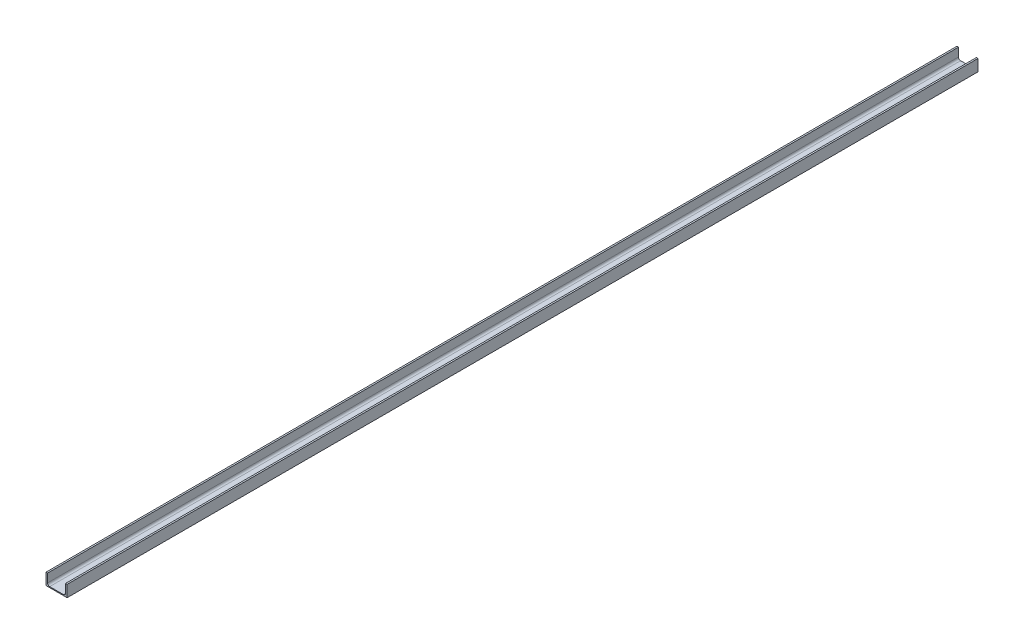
from build123d import *

# Parameters (mm, degrees)
EXTRUSION1_DEPTH        = 4317
ESQUISSE2_R             = 7.5
ENL_V_MAT_EXTRU_1_DEPTH = 10


with BuildPart() as part:
    # Esquisse1 → Extrusion1 (new body)
    with BuildSketch(Plane.XY):
        with BuildLine():
            Line((0, 0), (100, 0))
            Line((100, 0), (100, 55))
            Line((100, 55), (92.5, 55))
            Line((92.5, 55), (92.5, 14.5))
            ThreePointArc((92.5, 14.5), (89.571067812, 7.428932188), (82.5, 4.5))
            Line((82.5, 4.5), (17.5, 4.5))
            ThreePointArc((17.5, 4.5), (10.428932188, 7.428932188), (7.5, 14.5))
            Line((7.5, 14.5), (7.5, 55))
            Line((7.5, 55), (0, 55))
            Line((0, 55), (0, 0))
        make_face()
    extrude(amount=EXTRUSION1_DEPTH)

    # Esquisse2 → Enl_v. mat.-Extru.1 (cut)
    with BuildSketch(Plane(origin=(0, 4.5, 0), x_dir=(-1, 0, 0), z_dir=(0, 1, 0))):
        with Locations((-50, 4132)):
            Circle(ESQUISSE2_R)
        with Locations((-50, 3823)):
            Circle(ESQUISSE2_R)
        with Locations((-50, 3514)):
            Circle(ESQUISSE2_R)
        with Locations((-50, 3205)):
            Circle(ESQUISSE2_R)
        with Locations((-50, 2896)):
            Circle(ESQUISSE2_R)
        with Locations((-50, 2587)):
            Circle(ESQUISSE2_R)
        with Locations((-50, 2278)):
            Circle(ESQUISSE2_R)
        with Locations((-50, 1969)):
            Circle(ESQUISSE2_R)
        with Locations((-50, 1660)):
            Circle(ESQUISSE2_R)
        with Locations((-50, 1351)):
            Circle(ESQUISSE2_R)
        with Locations((-50, 1042)):
            Circle(ESQUISSE2_R)
        with Locations((-50, 733)):
            Circle(ESQUISSE2_R)
        with Locations((-50, 424)):
            Circle(ESQUISSE2_R)
        with Locations((-50, 115)):
            Circle(ESQUISSE2_R)
        with Locations((-50, 4227)):
            Circle(ESQUISSE2_R)
    extrude(amount=-ENL_V_MAT_EXTRU_1_DEPTH, mode=Mode.SUBTRACT)


solid = part.part
